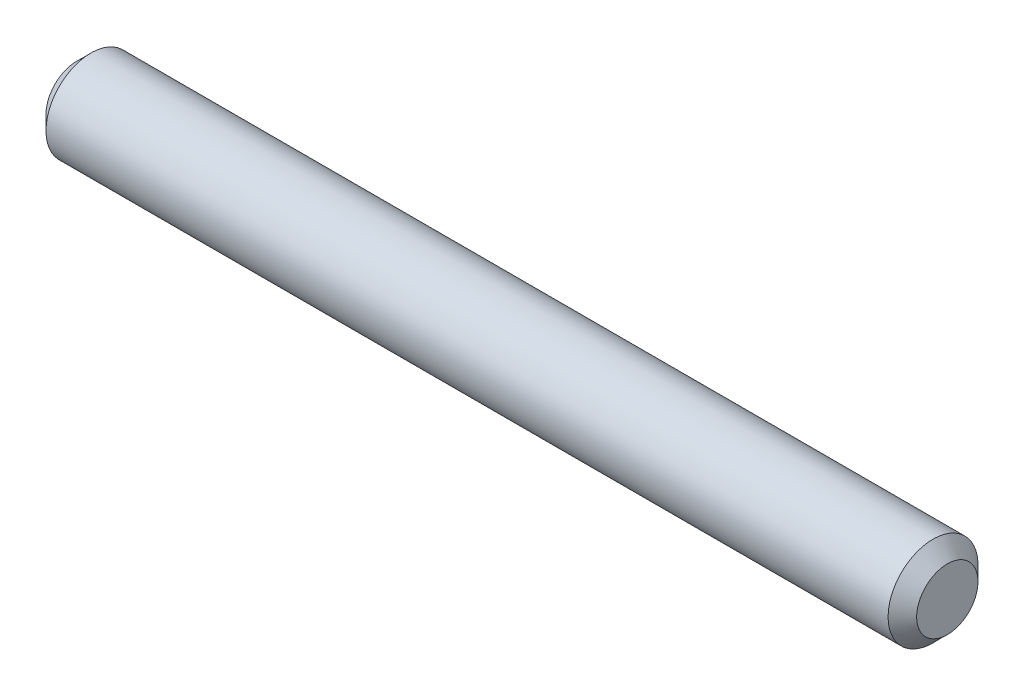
ISO-10303-21;
HEADER;
FILE_DESCRIPTION(('STEP AP214'),'2;1');
FILE_NAME('part.step','',(''),(''),'','','');
FILE_SCHEMA(('AUTOMOTIVE_DESIGN { 1 0 10303 214 1 1 1 1 }'));
ENDSEC;
DATA;
#1=APPLICATION_CONTEXT('core data for automotive mechanical design processes');
#2=APPLICATION_PROTOCOL_DEFINITION('international standard','automotive_design',2000,#1);
#3=PRODUCT_CONTEXT('',#1,'mechanical');
#4=PRODUCT('Part','Part','',(#3));
#5=PRODUCT_RELATED_PRODUCT_CATEGORY('part','',(#4));
#6=PRODUCT_DEFINITION_FORMATION('','',#4);
#7=PRODUCT_DEFINITION_CONTEXT('part definition',#1,'design');
#8=PRODUCT_DEFINITION('design','',#6,#7);
#9=PRODUCT_DEFINITION_SHAPE('','',#8);
#10=(LENGTH_UNIT() NAMED_UNIT(*) SI_UNIT(.MILLI.,.METRE.));
#11=(NAMED_UNIT(*) PLANE_ANGLE_UNIT() SI_UNIT($,.RADIAN.));
#12=(NAMED_UNIT(*) SI_UNIT($,.STERADIAN.) SOLID_ANGLE_UNIT());
#13=UNCERTAINTY_MEASURE_WITH_UNIT(LENGTH_MEASURE(1.E-05),#10,'distance_accuracy_value','');
#14=(GEOMETRIC_REPRESENTATION_CONTEXT(3) GLOBAL_UNCERTAINTY_ASSIGNED_CONTEXT((#13)) GLOBAL_UNIT_ASSIGNED_CONTEXT((#10,
#11,#12)) REPRESENTATION_CONTEXT('',''));
#15=CARTESIAN_POINT('',(0.,0.,0.));
#16=DIRECTION('',(0.,0.,1.));
#17=DIRECTION('',(1.,0.,0.));
#18=AXIS2_PLACEMENT_3D('',#15,#16,#17);
#19=CARTESIAN_POINT('',(0.,0.,0.));
#20=DIRECTION('',(1.,0.,0.));
#21=DIRECTION('',(0.,0.,-1.));
#22=AXIS2_PLACEMENT_3D('',#19,#20,#21);
#23=PLANE('',#22);
#24=CARTESIAN_POINT('',(0.,0.,0.));
#25=DIRECTION('',(-1.,0.,0.));
#26=DIRECTION('',(0.,0.,1.));
#27=AXIS2_PLACEMENT_3D('',#24,#25,#26);
#28=CIRCLE('',#27,0.5461);
#29=CARTESIAN_POINT('',(0.,0.,0.5461));
#30=VERTEX_POINT('',#29);
#31=EDGE_CURVE('E10',#30,#30,#28,.T.);
#32=ORIENTED_EDGE('',*,*,#31,.T.);
#33=EDGE_LOOP('',(#32));
#34=FACE_BOUND('',#33,.T.);
#35=ADVANCED_FACE('F32',(#34),#23,.F.);
#36=CARTESIAN_POINT('',(0.254000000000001,0.,0.));
#37=DIRECTION('',(1.,0.,0.));
#38=DIRECTION('',(0.,0.,-1.));
#39=AXIS2_PLACEMENT_3D('',#36,#37,#38);
#40=CONICAL_SURFACE('',#39,0.8001,0.785398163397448);
#41=ORIENTED_EDGE('',*,*,#31,.F.);
#42=EDGE_LOOP('',(#41));
#43=FACE_BOUND('',#42,.T.);
#44=CARTESIAN_POINT('',(0.254000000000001,0.,0.));
#45=DIRECTION('',(-1.,0.,0.));
#46=DIRECTION('',(0.,0.,1.));
#47=AXIS2_PLACEMENT_3D('',#44,#45,#46);
#48=CIRCLE('',#47,0.8001);
#49=CARTESIAN_POINT('',(0.254000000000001,0.,0.8001));
#50=VERTEX_POINT('',#49);
#51=EDGE_CURVE('E38',#50,#50,#48,.T.);
#52=ORIENTED_EDGE('',*,*,#51,.T.);
#53=EDGE_LOOP('',(#52));
#54=FACE_BOUND('',#53,.T.);
#55=ADVANCED_FACE('F64',(#43,#54),#40,.T.);
#56=CARTESIAN_POINT('',(0.,0.,0.));
#57=DIRECTION('',(-1.,0.,0.));
#58=DIRECTION('',(0.,0.,1.));
#59=AXIS2_PLACEMENT_3D('',#56,#57,#58);
#60=CYLINDRICAL_SURFACE('',#59,0.8001);
#61=ORIENTED_EDGE('',*,*,#51,.F.);
#62=EDGE_LOOP('',(#61));
#63=FACE_BOUND('',#62,.T.);
#64=CARTESIAN_POINT('',(15.24,0.,0.));
#65=DIRECTION('',(-1.,0.,0.));
#66=DIRECTION('',(0.,0.,1.));
#67=AXIS2_PLACEMENT_3D('',#64,#65,#66);
#68=CIRCLE('',#67,0.8001);
#69=CARTESIAN_POINT('',(15.24,0.,0.8001));
#70=VERTEX_POINT('',#69);
#71=EDGE_CURVE('E42',#70,#70,#68,.T.);
#72=ORIENTED_EDGE('',*,*,#71,.T.);
#73=EDGE_LOOP('',(#72));
#74=FACE_BOUND('',#73,.T.);
#75=ADVANCED_FACE('F60',(#63,#74),#60,.T.);
#76=CARTESIAN_POINT('',(15.494,0.,0.));
#77=DIRECTION('',(-1.,0.,0.));
#78=DIRECTION('',(0.,0.,1.));
#79=AXIS2_PLACEMENT_3D('',#76,#77,#78);
#80=CONICAL_SURFACE('',#79,0.546100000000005,0.78539816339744);
#81=ORIENTED_EDGE('',*,*,#71,.F.);
#82=EDGE_LOOP('',(#81));
#83=FACE_BOUND('',#82,.T.);
#84=CARTESIAN_POINT('',(15.494,0.,0.));
#85=DIRECTION('',(-1.,0.,0.));
#86=DIRECTION('',(0.,0.,1.));
#87=AXIS2_PLACEMENT_3D('',#84,#85,#86);
#88=CIRCLE('',#87,0.546100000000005);
#89=CARTESIAN_POINT('',(15.494,0.,0.546100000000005));
#90=VERTEX_POINT('',#89);
#91=EDGE_CURVE('E46',#90,#90,#88,.T.);
#92=ORIENTED_EDGE('',*,*,#91,.T.);
#93=EDGE_LOOP('',(#92));
#94=FACE_BOUND('',#93,.T.);
#95=ADVANCED_FACE('F52',(#83,#94),#80,.T.);
#96=CARTESIAN_POINT('',(15.494,0.546100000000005,0.));
#97=DIRECTION('',(-1.,0.,0.));
#98=DIRECTION('',(0.,0.,1.));
#99=AXIS2_PLACEMENT_3D('',#96,#97,#98);
#100=PLANE('',#99);
#101=ORIENTED_EDGE('',*,*,#91,.F.);
#102=EDGE_LOOP('',(#101));
#103=FACE_BOUND('',#102,.T.);
#104=ADVANCED_FACE('F54',(#103),#100,.F.);
#105=CLOSED_SHELL('',(#35,#55,#75,#95,#104));
#106=MANIFOLD_SOLID_BREP('B2',#105);
#107=ADVANCED_BREP_SHAPE_REPRESENTATION('',(#18,#106),#14);
#108=SHAPE_DEFINITION_REPRESENTATION(#9,#107);
ENDSEC;
END-ISO-10303-21;
